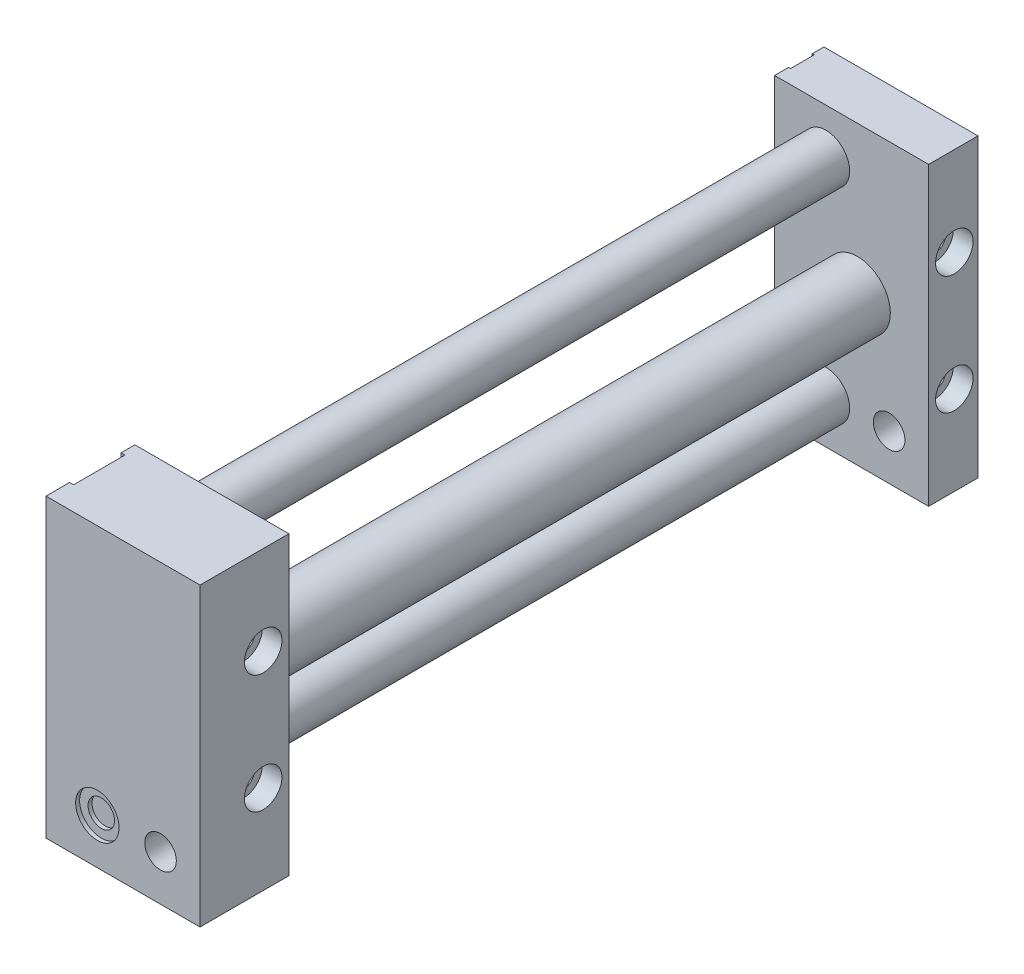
ISO-10303-21;
HEADER;
FILE_DESCRIPTION(('STEP AP214'),'2;1');
FILE_NAME('part.step','',(''),(''),'','','');
FILE_SCHEMA(('AUTOMOTIVE_DESIGN { 1 0 10303 214 1 1 1 1 }'));
ENDSEC;
DATA;
#1=APPLICATION_CONTEXT('core data for automotive mechanical design processes');
#2=APPLICATION_PROTOCOL_DEFINITION('international standard','automotive_design',2000,#1);
#3=PRODUCT_CONTEXT('',#1,'mechanical');
#4=PRODUCT('Part','Part','',(#3));
#5=PRODUCT_RELATED_PRODUCT_CATEGORY('part','',(#4));
#6=PRODUCT_DEFINITION_FORMATION('','',#4);
#7=PRODUCT_DEFINITION_CONTEXT('part definition',#1,'design');
#8=PRODUCT_DEFINITION('design','',#6,#7);
#9=PRODUCT_DEFINITION_SHAPE('','',#8);
#10=(LENGTH_UNIT() NAMED_UNIT(*) SI_UNIT(.MILLI.,.METRE.));
#11=(NAMED_UNIT(*) PLANE_ANGLE_UNIT() SI_UNIT($,.RADIAN.));
#12=(NAMED_UNIT(*) SI_UNIT($,.STERADIAN.) SOLID_ANGLE_UNIT());
#13=UNCERTAINTY_MEASURE_WITH_UNIT(LENGTH_MEASURE(1.E-05),#10,'distance_accuracy_value','');
#14=(GEOMETRIC_REPRESENTATION_CONTEXT(3) GLOBAL_UNCERTAINTY_ASSIGNED_CONTEXT((#13)) GLOBAL_UNIT_ASSIGNED_CONTEXT((#10,
#11,#12)) REPRESENTATION_CONTEXT('',''));
#15=CARTESIAN_POINT('',(0.,0.,0.));
#16=DIRECTION('',(0.,0.,1.));
#17=DIRECTION('',(1.,0.,0.));
#18=AXIS2_PLACEMENT_3D('',#15,#16,#17);
#19=CARTESIAN_POINT('',(-8.,-26.,-172.5));
#20=DIRECTION('',(0.,0.,1.));
#21=DIRECTION('',(1.,0.,0.));
#22=AXIS2_PLACEMENT_3D('',#19,#20,#21);
#23=PLANE('',#22);
#24=CARTESIAN_POINT('',(-8.,-26.,-172.5));
#25=DIRECTION('',(0.,0.,-1.));
#26=DIRECTION('',(-1.,0.,0.));
#27=AXIS2_PLACEMENT_3D('',#24,#25,#26);
#28=CIRCLE('',#27,3.35);
#29=CARTESIAN_POINT('',(-11.35,-26.,-172.5));
#30=VERTEX_POINT('',#29);
#31=EDGE_CURVE('E20',#30,#30,#28,.T.);
#32=ORIENTED_EDGE('',*,*,#31,.T.);
#33=EDGE_LOOP('',(#32));
#34=FACE_BOUND('',#33,.T.);
#35=ADVANCED_FACE('F17',(#34),#23,.F.);
#36=CARTESIAN_POINT('',(-8.,-26.,20.5));
#37=DIRECTION('',(0.,0.,1.));
#38=DIRECTION('',(1.,0.,0.));
#39=AXIS2_PLACEMENT_3D('',#36,#37,#38);
#40=PLANE('',#39);
#41=CARTESIAN_POINT('',(-8.,-26.,20.5));
#42=DIRECTION('',(0.,0.,1.));
#43=DIRECTION('',(1.,0.,0.));
#44=AXIS2_PLACEMENT_3D('',#41,#42,#43);
#45=CIRCLE('',#44,3.35);
#46=CARTESIAN_POINT('',(-4.65,-26.,20.5));
#47=VERTEX_POINT('',#46);
#48=EDGE_CURVE('E300',#47,#47,#45,.T.);
#49=ORIENTED_EDGE('',*,*,#48,.T.);
#50=EDGE_LOOP('',(#49));
#51=FACE_BOUND('',#50,.T.);
#52=ADVANCED_FACE('F138',(#51),#40,.T.);
#53=CARTESIAN_POINT('',(0.,0.,-168.499999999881));
#54=DIRECTION('',(0.,0.,-1.));
#55=DIRECTION('',(-1.,0.,0.));
#56=AXIS2_PLACEMENT_3D('',#53,#54,#55);
#57=CONICAL_SURFACE('',#56,2.06699999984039,1.04719755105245);
#58=CARTESIAN_POINT('',(2.55795384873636E-10,0.,-167.306616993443));
#59=VERTEX_POINT('',#58);
#60=VERTEX_LOOP('',#59);
#61=FACE_BOUND('',#60,.T.);
#62=CARTESIAN_POINT('',(0.,0.,-168.5));
#63=DIRECTION('',(0.,0.,1.));
#64=DIRECTION('',(1.,0.,0.));
#65=AXIS2_PLACEMENT_3D('',#62,#63,#64);
#66=CIRCLE('',#65,2.067);
#67=CARTESIAN_POINT('',(2.067,0.,-168.5));
#68=VERTEX_POINT('',#67);
#69=EDGE_CURVE('E142',#68,#68,#66,.F.);
#70=ORIENTED_EDGE('',*,*,#69,.T.);
#71=EDGE_LOOP('',(#70));
#72=FACE_BOUND('',#71,.T.);
#73=ADVANCED_FACE('F134',(#61,#72),#57,.F.);
#74=CARTESIAN_POINT('',(-8.,26.,-168.499999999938));
#75=DIRECTION('',(0.,0.,-1.));
#76=DIRECTION('',(-1.,0.,0.));
#77=AXIS2_PLACEMENT_3D('',#74,#75,#76);
#78=CONICAL_SURFACE('',#77,2.06699999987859,1.04719755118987);
#79=CARTESIAN_POINT('',(-7.99999999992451,26.,-167.306616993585));
#80=VERTEX_POINT('',#79);
#81=VERTEX_LOOP('',#80);
#82=FACE_BOUND('',#81,.T.);
#83=CARTESIAN_POINT('',(-8.,26.,-168.5));
#84=DIRECTION('',(0.,0.,1.));
#85=DIRECTION('',(1.,0.,0.));
#86=AXIS2_PLACEMENT_3D('',#83,#84,#85);
#87=CIRCLE('',#86,2.067);
#88=CARTESIAN_POINT('',(-5.933,26.,-168.5));
#89=VERTEX_POINT('',#88);
#90=EDGE_CURVE('E144',#89,#89,#87,.F.);
#91=ORIENTED_EDGE('',*,*,#90,.T.);
#92=EDGE_LOOP('',(#91));
#93=FACE_BOUND('',#92,.T.);
#94=ADVANCED_FACE('F137',(#82,#93),#78,.F.);
#95=CARTESIAN_POINT('',(-8.,-26.,-172.5));
#96=DIRECTION('',(0.,0.,-1.));
#97=DIRECTION('',(-1.,0.,0.));
#98=AXIS2_PLACEMENT_3D('',#95,#96,#97);
#99=CYLINDRICAL_SURFACE('',#98,3.35);
#100=ORIENTED_EDGE('',*,*,#31,.F.);
#101=EDGE_LOOP('',(#100));
#102=FACE_BOUND('',#101,.T.);
#103=CARTESIAN_POINT('',(-8.,-26.,-173.5));
#104=DIRECTION('',(0.,0.,-1.));
#105=DIRECTION('',(-1.,0.,0.));
#106=AXIS2_PLACEMENT_3D('',#103,#104,#105);
#107=CIRCLE('',#106,3.35);
#108=CARTESIAN_POINT('',(-11.35,-26.,-173.5));
#109=VERTEX_POINT('',#108);
#110=EDGE_CURVE('E148',#109,#109,#107,.T.);
#111=ORIENTED_EDGE('',*,*,#110,.T.);
#112=EDGE_LOOP('',(#111));
#113=FACE_BOUND('',#112,.T.);
#114=ADVANCED_FACE('F308',(#102,#113),#99,.F.);
#115=CARTESIAN_POINT('',(-11.5,15.,-170.9585));
#116=DIRECTION('',(1.,0.,0.));
#117=DIRECTION('',(0.,0.,-1.));
#118=AXIS2_PLACEMENT_3D('',#115,#116,#117);
#119=PLANE('',#118);
#120=CARTESIAN_POINT('',(-11.5,15.,-168.5));
#121=DIRECTION('',(-1.,0.,0.));
#122=DIRECTION('',(0.,0.,1.));
#123=AXIS2_PLACEMENT_3D('',#120,#121,#122);
#124=CIRCLE('',#123,2.8);
#125=CARTESIAN_POINT('',(-11.5,15.,-165.7));
#126=VERTEX_POINT('',#125);
#127=EDGE_CURVE('E151',#126,#126,#124,.F.);
#128=ORIENTED_EDGE('',*,*,#127,.T.);
#129=EDGE_LOOP('',(#128));
#130=FACE_BOUND('',#129,.T.);
#131=CARTESIAN_POINT('',(-11.5,15.,-168.5));
#132=DIRECTION('',(-1.,0.,0.));
#133=DIRECTION('',(0.,0.,1.));
#134=AXIS2_PLACEMENT_3D('',#131,#132,#133);
#135=CIRCLE('',#134,2.4585);
#136=CARTESIAN_POINT('',(-11.5,15.,-166.0415));
#137=VERTEX_POINT('',#136);
#138=EDGE_CURVE('E294',#137,#137,#135,.T.);
#139=ORIENTED_EDGE('',*,*,#138,.T.);
#140=EDGE_LOOP('',(#139));
#141=FACE_BOUND('',#140,.T.);
#142=ADVANCED_FACE('F311',(#130,#141),#119,.T.);
#143=CARTESIAN_POINT('',(-11.5,-15.,-170.9585));
#144=DIRECTION('',(1.,0.,0.));
#145=DIRECTION('',(0.,0.,-1.));
#146=AXIS2_PLACEMENT_3D('',#143,#144,#145);
#147=PLANE('',#146);
#148=CARTESIAN_POINT('',(-11.5,-15.,-168.5));
#149=DIRECTION('',(-1.,0.,0.));
#150=DIRECTION('',(0.,0.,1.));
#151=AXIS2_PLACEMENT_3D('',#148,#149,#150);
#152=CIRCLE('',#151,2.8);
#153=CARTESIAN_POINT('',(-11.5,-15.,-165.7));
#154=VERTEX_POINT('',#153);
#155=EDGE_CURVE('E145',#154,#154,#152,.F.);
#156=ORIENTED_EDGE('',*,*,#155,.T.);
#157=EDGE_LOOP('',(#156));
#158=FACE_BOUND('',#157,.T.);
#159=CARTESIAN_POINT('',(-11.5,-15.,-168.5));
#160=DIRECTION('',(-1.,0.,0.));
#161=DIRECTION('',(0.,0.,1.));
#162=AXIS2_PLACEMENT_3D('',#159,#160,#161);
#163=CIRCLE('',#162,2.4585);
#164=CARTESIAN_POINT('',(-11.5,-15.,-166.0415));
#165=VERTEX_POINT('',#164);
#166=EDGE_CURVE('E291',#165,#165,#163,.T.);
#167=ORIENTED_EDGE('',*,*,#166,.T.);
#168=EDGE_LOOP('',(#167));
#169=FACE_BOUND('',#168,.T.);
#170=ADVANCED_FACE('F605',(#158,#169),#147,.T.);
#171=CARTESIAN_POINT('',(-8.,-26.,20.5));
#172=DIRECTION('',(0.,0.,1.));
#173=DIRECTION('',(1.,0.,0.));
#174=AXIS2_PLACEMENT_3D('',#171,#172,#173);
#175=CYLINDRICAL_SURFACE('',#174,3.35);
#176=CARTESIAN_POINT('',(-8.,-26.,21.5));
#177=DIRECTION('',(0.,0.,1.));
#178=DIRECTION('',(1.,0.,0.));
#179=AXIS2_PLACEMENT_3D('',#176,#177,#178);
#180=CIRCLE('',#179,3.35);
#181=CARTESIAN_POINT('',(-4.65,-26.,21.5));
#182=VERTEX_POINT('',#181);
#183=EDGE_CURVE('E285',#182,#182,#180,.F.);
#184=ORIENTED_EDGE('',*,*,#183,.F.);
#185=EDGE_LOOP('',(#184));
#186=FACE_BOUND('',#185,.T.);
#187=ORIENTED_EDGE('',*,*,#48,.F.);
#188=EDGE_LOOP('',(#187));
#189=FACE_BOUND('',#188,.T.);
#190=ADVANCED_FACE('F601',(#186,#189),#175,.F.);
#191=CARTESIAN_POINT('',(18.,15.,-168.5));
#192=DIRECTION('',(-1.,0.,0.));
#193=DIRECTION('',(0.,0.,1.));
#194=AXIS2_PLACEMENT_3D('',#191,#192,#193);
#195=CYLINDRICAL_SURFACE('',#194,2.8);
#196=ORIENTED_EDGE('',*,*,#127,.F.);
#197=EDGE_LOOP('',(#196));
#198=FACE_BOUND('',#197,.T.);
#199=CARTESIAN_POINT('',(12.9999999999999,15.,-168.5));
#200=DIRECTION('',(-1.,0.,0.));
#201=DIRECTION('',(0.,0.,1.));
#202=AXIS2_PLACEMENT_3D('',#199,#200,#201);
#203=CIRCLE('',#202,2.8);
#204=CARTESIAN_POINT('',(12.9999999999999,15.,-165.7));
#205=VERTEX_POINT('',#204);
#206=EDGE_CURVE('E279',#205,#205,#203,.T.);
#207=ORIENTED_EDGE('',*,*,#206,.F.);
#208=EDGE_LOOP('',(#207));
#209=FACE_BOUND('',#208,.T.);
#210=ADVANCED_FACE('F597',(#198,#209),#195,.F.);
#211=CARTESIAN_POINT('',(18.,-15.,-168.5));
#212=DIRECTION('',(-1.,0.,0.));
#213=DIRECTION('',(0.,0.,1.));
#214=AXIS2_PLACEMENT_3D('',#211,#212,#213);
#215=CYLINDRICAL_SURFACE('',#214,2.8);
#216=ORIENTED_EDGE('',*,*,#155,.F.);
#217=EDGE_LOOP('',(#216));
#218=FACE_BOUND('',#217,.T.);
#219=CARTESIAN_POINT('',(12.9999999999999,-15.,-168.5));
#220=DIRECTION('',(-1.,0.,0.));
#221=DIRECTION('',(0.,0.,1.));
#222=AXIS2_PLACEMENT_3D('',#219,#220,#221);
#223=CIRCLE('',#222,2.8);
#224=CARTESIAN_POINT('',(12.9999999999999,-15.,-165.7));
#225=VERTEX_POINT('',#224);
#226=EDGE_CURVE('E275',#225,#225,#223,.T.);
#227=ORIENTED_EDGE('',*,*,#226,.F.);
#228=EDGE_LOOP('',(#227));
#229=FACE_BOUND('',#228,.T.);
#230=ADVANCED_FACE('F594',(#218,#229),#215,.F.);
#231=CARTESIAN_POINT('',(0.,0.,-174.5));
#232=DIRECTION('',(0.,0.,1.));
#233=DIRECTION('',(1.,0.,0.));
#234=AXIS2_PLACEMENT_3D('',#231,#232,#233);
#235=CYLINDRICAL_SURFACE('',#234,2.067);
#236=ORIENTED_EDGE('',*,*,#69,.F.);
#237=EDGE_LOOP('',(#236));
#238=FACE_BOUND('',#237,.T.);
#239=CARTESIAN_POINT('',(0.,0.,-174.067000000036));
#240=DIRECTION('',(0.,0.,-1.));
#241=DIRECTION('',(-1.,0.,0.));
#242=AXIS2_PLACEMENT_3D('',#239,#240,#241);
#243=CIRCLE('',#242,2.06700000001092);
#244=CARTESIAN_POINT('',(-2.06700000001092,0.,-174.067000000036));
#245=VERTEX_POINT('',#244);
#246=EDGE_CURVE('E278',#245,#245,#243,.T.);
#247=ORIENTED_EDGE('',*,*,#246,.T.);
#248=EDGE_LOOP('',(#247));
#249=FACE_BOUND('',#248,.T.);
#250=ADVANCED_FACE('F546',(#238,#249),#235,.F.);
#251=CARTESIAN_POINT('',(-8.,26.,-174.5));
#252=DIRECTION('',(0.,0.,1.));
#253=DIRECTION('',(1.,0.,0.));
#254=AXIS2_PLACEMENT_3D('',#251,#252,#253);
#255=CYLINDRICAL_SURFACE('',#254,2.067);
#256=ORIENTED_EDGE('',*,*,#90,.F.);
#257=EDGE_LOOP('',(#256));
#258=FACE_BOUND('',#257,.T.);
#259=CARTESIAN_POINT('',(-8.,26.,-174.067000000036));
#260=DIRECTION('',(0.,0.,-1.));
#261=DIRECTION('',(-1.,0.,0.));
#262=AXIS2_PLACEMENT_3D('',#259,#260,#261);
#263=CIRCLE('',#262,2.06699999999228);
#264=CARTESIAN_POINT('',(-10.0669999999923,26.,-174.067000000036));
#265=VERTEX_POINT('',#264);
#266=EDGE_CURVE('E274',#265,#265,#263,.T.);
#267=ORIENTED_EDGE('',*,*,#266,.T.);
#268=EDGE_LOOP('',(#267));
#269=FACE_BOUND('',#268,.T.);
#270=ADVANCED_FACE('F319',(#258,#269),#255,.F.);
#271=CARTESIAN_POINT('',(-8.,-26.,-173.5));
#272=DIRECTION('',(0.,0.,1.));
#273=DIRECTION('',(1.,0.,0.));
#274=AXIS2_PLACEMENT_3D('',#271,#272,#273);
#275=PLANE('',#274);
#276=ORIENTED_EDGE('',*,*,#110,.F.);
#277=EDGE_LOOP('',(#276));
#278=FACE_BOUND('',#277,.T.);
#279=CARTESIAN_POINT('',(-8.,-26.,-173.5));
#280=DIRECTION('',(0.,0.,-1.));
#281=DIRECTION('',(-1.,0.,0.));
#282=AXIS2_PLACEMENT_3D('',#279,#280,#281);
#283=CIRCLE('',#282,5.5);
#284=CARTESIAN_POINT('',(-13.5,-26.,-173.5));
#285=VERTEX_POINT('',#284);
#286=EDGE_CURVE('E270',#285,#285,#283,.T.);
#287=ORIENTED_EDGE('',*,*,#286,.T.);
#288=EDGE_LOOP('',(#287));
#289=FACE_BOUND('',#288,.T.);
#290=ADVANCED_FACE('F315',(#278,#289),#275,.F.);
#291=CARTESIAN_POINT('',(18.,15.,-168.5));
#292=DIRECTION('',(-1.,0.,0.));
#293=DIRECTION('',(0.,0.,1.));
#294=AXIS2_PLACEMENT_3D('',#291,#292,#293);
#295=CYLINDRICAL_SURFACE('',#294,2.4585);
#296=ORIENTED_EDGE('',*,*,#138,.F.);
#297=EDGE_LOOP('',(#296));
#298=FACE_BOUND('',#297,.T.);
#299=CARTESIAN_POINT('',(-20.4585000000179,15.,-168.5));
#300=DIRECTION('',(-1.,0.,0.));
#301=DIRECTION('',(0.,0.,1.));
#302=AXIS2_PLACEMENT_3D('',#299,#300,#301);
#303=CIRCLE('',#302,2.45849999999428);
#304=CARTESIAN_POINT('',(-20.4585000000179,15.,-166.041500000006));
#305=VERTEX_POINT('',#304);
#306=EDGE_CURVE('E273',#305,#305,#303,.T.);
#307=ORIENTED_EDGE('',*,*,#306,.T.);
#308=EDGE_LOOP('',(#307));
#309=FACE_BOUND('',#308,.T.);
#310=ADVANCED_FACE('F318',(#298,#309),#295,.F.);
#311=CARTESIAN_POINT('',(18.,-15.,-168.5));
#312=DIRECTION('',(-1.,0.,0.));
#313=DIRECTION('',(0.,0.,1.));
#314=AXIS2_PLACEMENT_3D('',#311,#312,#313);
#315=CYLINDRICAL_SURFACE('',#314,2.4585);
#316=ORIENTED_EDGE('',*,*,#166,.F.);
#317=EDGE_LOOP('',(#316));
#318=FACE_BOUND('',#317,.T.);
#319=CARTESIAN_POINT('',(-20.4585000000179,-15.,-168.5));
#320=DIRECTION('',(-1.,0.,0.));
#321=DIRECTION('',(0.,0.,1.));
#322=AXIS2_PLACEMENT_3D('',#319,#320,#321);
#323=CIRCLE('',#322,2.45849999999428);
#324=CARTESIAN_POINT('',(-20.4585000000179,-15.,-166.041500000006));
#325=VERTEX_POINT('',#324);
#326=EDGE_CURVE('E269',#325,#325,#323,.T.);
#327=ORIENTED_EDGE('',*,*,#326,.T.);
#328=EDGE_LOOP('',(#327));
#329=FACE_BOUND('',#328,.T.);
#330=ADVANCED_FACE('F581',(#318,#329),#315,.F.);
#331=CARTESIAN_POINT('',(-11.5,15.,4.0415));
#332=DIRECTION('',(1.,0.,0.));
#333=DIRECTION('',(0.,0.,-1.));
#334=AXIS2_PLACEMENT_3D('',#331,#332,#333);
#335=PLANE('',#334);
#336=CARTESIAN_POINT('',(-11.5,15.,6.5));
#337=DIRECTION('',(-1.,0.,0.));
#338=DIRECTION('',(0.,0.,1.));
#339=AXIS2_PLACEMENT_3D('',#336,#337,#338);
#340=CIRCLE('',#339,2.8);
#341=CARTESIAN_POINT('',(-11.5,15.,9.3));
#342=VERTEX_POINT('',#341);
#343=EDGE_CURVE('E288',#342,#342,#340,.F.);
#344=ORIENTED_EDGE('',*,*,#343,.T.);
#345=EDGE_LOOP('',(#344));
#346=FACE_BOUND('',#345,.T.);
#347=CARTESIAN_POINT('',(-11.5,15.,6.5));
#348=DIRECTION('',(-1.,0.,0.));
#349=DIRECTION('',(0.,0.,1.));
#350=AXIS2_PLACEMENT_3D('',#347,#348,#349);
#351=CIRCLE('',#350,2.4585);
#352=CARTESIAN_POINT('',(-11.5,15.,8.9585));
#353=VERTEX_POINT('',#352);
#354=EDGE_CURVE('E266',#353,#353,#351,.T.);
#355=ORIENTED_EDGE('',*,*,#354,.T.);
#356=EDGE_LOOP('',(#355));
#357=FACE_BOUND('',#356,.T.);
#358=ADVANCED_FACE('F577',(#346,#357),#335,.T.);
#359=CARTESIAN_POINT('',(-11.5,-15.,4.04150000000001));
#360=DIRECTION('',(1.,0.,0.));
#361=DIRECTION('',(0.,0.,-1.));
#362=AXIS2_PLACEMENT_3D('',#359,#360,#361);
#363=PLANE('',#362);
#364=CARTESIAN_POINT('',(-11.5,-15.,6.50000000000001));
#365=DIRECTION('',(-1.,0.,0.));
#366=DIRECTION('',(0.,0.,1.));
#367=AXIS2_PLACEMENT_3D('',#364,#365,#366);
#368=CIRCLE('',#367,2.8);
#369=CARTESIAN_POINT('',(-11.5,-15.,9.30000000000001));
#370=VERTEX_POINT('',#369);
#371=EDGE_CURVE('E282',#370,#370,#368,.F.);
#372=ORIENTED_EDGE('',*,*,#371,.T.);
#373=EDGE_LOOP('',(#372));
#374=FACE_BOUND('',#373,.T.);
#375=CARTESIAN_POINT('',(-11.5,-15.,6.50000000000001));
#376=DIRECTION('',(-1.,0.,0.));
#377=DIRECTION('',(0.,0.,1.));
#378=AXIS2_PLACEMENT_3D('',#375,#376,#377);
#379=CIRCLE('',#378,2.4585);
#380=CARTESIAN_POINT('',(-11.5,-15.,8.95850000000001));
#381=VERTEX_POINT('',#380);
#382=EDGE_CURVE('E262',#381,#381,#379,.T.);
#383=ORIENTED_EDGE('',*,*,#382,.T.);
#384=EDGE_LOOP('',(#383));
#385=FACE_BOUND('',#384,.T.);
#386=ADVANCED_FACE('F573',(#374,#385),#363,.T.);
#387=CARTESIAN_POINT('',(18.,15.,6.5));
#388=DIRECTION('',(-1.,0.,0.));
#389=DIRECTION('',(0.,0.,1.));
#390=AXIS2_PLACEMENT_3D('',#387,#388,#389);
#391=CYLINDRICAL_SURFACE('',#390,2.8);
#392=ORIENTED_EDGE('',*,*,#343,.F.);
#393=EDGE_LOOP('',(#392));
#394=FACE_BOUND('',#393,.T.);
#395=CARTESIAN_POINT('',(12.9999999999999,15.,6.5));
#396=DIRECTION('',(-1.,0.,0.));
#397=DIRECTION('',(0.,0.,1.));
#398=AXIS2_PLACEMENT_3D('',#395,#396,#397);
#399=CIRCLE('',#398,2.8);
#400=CARTESIAN_POINT('',(12.9999999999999,15.,9.3));
#401=VERTEX_POINT('',#400);
#402=EDGE_CURVE('E258',#401,#401,#399,.T.);
#403=ORIENTED_EDGE('',*,*,#402,.F.);
#404=EDGE_LOOP('',(#403));
#405=FACE_BOUND('',#404,.T.);
#406=ADVANCED_FACE('F569',(#394,#405),#391,.F.);
#407=CARTESIAN_POINT('',(-8.,-26.,21.5));
#408=DIRECTION('',(0.,0.,1.));
#409=DIRECTION('',(1.,0.,0.));
#410=AXIS2_PLACEMENT_3D('',#407,#408,#409);
#411=PLANE('',#410);
#412=CARTESIAN_POINT('',(-8.,-26.,21.5));
#413=DIRECTION('',(0.,0.,1.));
#414=DIRECTION('',(1.,0.,0.));
#415=AXIS2_PLACEMENT_3D('',#412,#413,#414);
#416=CIRCLE('',#415,5.5);
#417=CARTESIAN_POINT('',(-2.5,-26.,21.5));
#418=VERTEX_POINT('',#417);
#419=EDGE_CURVE('E255',#418,#418,#416,.T.);
#420=ORIENTED_EDGE('',*,*,#419,.T.);
#421=EDGE_LOOP('',(#420));
#422=FACE_BOUND('',#421,.T.);
#423=ORIENTED_EDGE('',*,*,#183,.T.);
#424=EDGE_LOOP('',(#423));
#425=FACE_BOUND('',#424,.T.);
#426=ADVANCED_FACE('F565',(#422,#425),#411,.T.);
#427=CARTESIAN_POINT('',(18.,-15.,6.50000000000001));
#428=DIRECTION('',(-1.,0.,0.));
#429=DIRECTION('',(0.,0.,1.));
#430=AXIS2_PLACEMENT_3D('',#427,#428,#429);
#431=CYLINDRICAL_SURFACE('',#430,2.8);
#432=ORIENTED_EDGE('',*,*,#371,.F.);
#433=EDGE_LOOP('',(#432));
#434=FACE_BOUND('',#433,.T.);
#435=CARTESIAN_POINT('',(12.9999999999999,-15.,6.50000000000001));
#436=DIRECTION('',(-1.,0.,0.));
#437=DIRECTION('',(0.,0.,1.));
#438=AXIS2_PLACEMENT_3D('',#435,#436,#437);
#439=CIRCLE('',#438,2.8);
#440=CARTESIAN_POINT('',(12.9999999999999,-15.,9.30000000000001));
#441=VERTEX_POINT('',#440);
#442=EDGE_CURVE('E252',#441,#441,#439,.T.);
#443=ORIENTED_EDGE('',*,*,#442,.F.);
#444=EDGE_LOOP('',(#443));
#445=FACE_BOUND('',#444,.T.);
#446=ADVANCED_FACE('F561',(#434,#445),#431,.F.);
#447=CARTESIAN_POINT('',(12.9999999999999,15.,-171.3));
#448=DIRECTION('',(1.,0.,0.));
#449=DIRECTION('',(0.,0.,-1.));
#450=AXIS2_PLACEMENT_3D('',#447,#448,#449);
#451=PLANE('',#450);
#452=CARTESIAN_POINT('',(12.9999999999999,15.,-168.5));
#453=DIRECTION('',(-1.,0.,0.));
#454=DIRECTION('',(0.,0.,1.));
#455=AXIS2_PLACEMENT_3D('',#452,#453,#454);
#456=CIRCLE('',#455,4.75);
#457=CARTESIAN_POINT('',(12.9999999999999,15.,-163.75));
#458=VERTEX_POINT('',#457);
#459=EDGE_CURVE('E249',#458,#458,#456,.F.);
#460=ORIENTED_EDGE('',*,*,#459,.T.);
#461=EDGE_LOOP('',(#460));
#462=FACE_BOUND('',#461,.T.);
#463=ORIENTED_EDGE('',*,*,#206,.T.);
#464=EDGE_LOOP('',(#463));
#465=FACE_BOUND('',#464,.T.);
#466=ADVANCED_FACE('F555',(#462,#465),#451,.T.);
#467=CARTESIAN_POINT('',(12.9999999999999,-15.,-171.3));
#468=DIRECTION('',(1.,0.,0.));
#469=DIRECTION('',(0.,0.,-1.));
#470=AXIS2_PLACEMENT_3D('',#467,#468,#469);
#471=PLANE('',#470);
#472=CARTESIAN_POINT('',(12.9999999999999,-15.,-168.5));
#473=DIRECTION('',(-1.,0.,0.));
#474=DIRECTION('',(0.,0.,1.));
#475=AXIS2_PLACEMENT_3D('',#472,#473,#474);
#476=CIRCLE('',#475,4.75);
#477=CARTESIAN_POINT('',(12.9999999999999,-15.,-163.75));
#478=VERTEX_POINT('',#477);
#479=EDGE_CURVE('E246',#478,#478,#476,.F.);
#480=ORIENTED_EDGE('',*,*,#479,.T.);
#481=EDGE_LOOP('',(#480));
#482=FACE_BOUND('',#481,.T.);
#483=ORIENTED_EDGE('',*,*,#226,.T.);
#484=EDGE_LOOP('',(#483));
#485=FACE_BOUND('',#484,.T.);
#486=ADVANCED_FACE('F549',(#482,#485),#471,.T.);
#487=CARTESIAN_POINT('',(0.,0.,-174.499999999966));
#488=DIRECTION('',(0.,0.,-1.));
#489=DIRECTION('',(-1.,0.,0.));
#490=AXIS2_PLACEMENT_3D('',#487,#488,#489);
#491=CONICAL_SURFACE('',#490,2.49999999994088,0.785398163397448);
#492=CARTESIAN_POINT('',(0.,0.,-174.500000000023));
#493=DIRECTION('',(0.,0.,-1.));
#494=DIRECTION('',(-1.,0.,0.));
#495=AXIS2_PLACEMENT_3D('',#492,#493,#494);
#496=CIRCLE('',#495,2.49999999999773);
#497=CARTESIAN_POINT('',(-2.49999999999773,0.,-174.500000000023));
#498=VERTEX_POINT('',#497);
#499=EDGE_CURVE('E243',#498,#498,#496,.T.);
#500=ORIENTED_EDGE('',*,*,#499,.T.);
#501=EDGE_LOOP('',(#500));
#502=FACE_BOUND('',#501,.T.);
#503=ORIENTED_EDGE('',*,*,#246,.F.);
#504=EDGE_LOOP('',(#503));
#505=FACE_BOUND('',#504,.T.);
#506=ADVANCED_FACE('F337',(#502,#505),#491,.F.);
#507=CARTESIAN_POINT('',(-8.,26.,-174.500000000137));
#508=DIRECTION('',(0.,0.,-1.));
#509=DIRECTION('',(-1.,0.,0.));
#510=AXIS2_PLACEMENT_3D('',#507,#508,#509);
#511=CONICAL_SURFACE('',#510,2.50000000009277,0.785398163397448);
#512=CARTESIAN_POINT('',(-8.,26.,-174.500000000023));
#513=DIRECTION('',(0.,0.,-1.));
#514=DIRECTION('',(-1.,0.,0.));
#515=AXIS2_PLACEMENT_3D('',#512,#513,#514);
#516=CIRCLE('',#515,2.49999999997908);
#517=CARTESIAN_POINT('',(-10.4999999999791,26.,-174.500000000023));
#518=VERTEX_POINT('',#517);
#519=EDGE_CURVE('E240',#518,#518,#516,.T.);
#520=ORIENTED_EDGE('',*,*,#519,.T.);
#521=EDGE_LOOP('',(#520));
#522=FACE_BOUND('',#521,.T.);
#523=ORIENTED_EDGE('',*,*,#266,.F.);
#524=EDGE_LOOP('',(#523));
#525=FACE_BOUND('',#524,.T.);
#526=ADVANCED_FACE('F326',(#522,#525),#511,.F.);
#527=CARTESIAN_POINT('',(-8.,-26.,-173.5));
#528=DIRECTION('',(0.,0.,-1.));
#529=DIRECTION('',(-1.,0.,0.));
#530=AXIS2_PLACEMENT_3D('',#527,#528,#529);
#531=CYLINDRICAL_SURFACE('',#530,5.5);
#532=CARTESIAN_POINT('',(-8.,-26.,-174.5));
#533=DIRECTION('',(0.,0.,-1.));
#534=DIRECTION('',(-1.,0.,0.));
#535=AXIS2_PLACEMENT_3D('',#532,#533,#534);
#536=CIRCLE('',#535,5.5);
#537=CARTESIAN_POINT('',(-13.5,-26.,-174.5));
#538=VERTEX_POINT('',#537);
#539=EDGE_CURVE('E236',#538,#538,#536,.T.);
#540=ORIENTED_EDGE('',*,*,#539,.T.);
#541=EDGE_LOOP('',(#540));
#542=FACE_BOUND('',#541,.T.);
#543=ORIENTED_EDGE('',*,*,#286,.F.);
#544=EDGE_LOOP('',(#543));
#545=FACE_BOUND('',#544,.T.);
#546=ADVANCED_FACE('F323',(#542,#545),#531,.F.);
#547=CARTESIAN_POINT('',(-20.5000000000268,15.,-168.5));
#548=DIRECTION('',(-1.,0.,0.));
#549=DIRECTION('',(0.,0.,1.));
#550=AXIS2_PLACEMENT_3D('',#547,#548,#549);
#551=CONICAL_SURFACE('',#550,2.50000000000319,0.785398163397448);
#552=ORIENTED_EDGE('',*,*,#306,.F.);
#553=EDGE_LOOP('',(#552));
#554=FACE_BOUND('',#553,.T.);
#555=CARTESIAN_POINT('',(-20.5000000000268,15.,-168.5));
#556=DIRECTION('',(-1.,0.,0.));
#557=DIRECTION('',(0.,0.,1.));
#558=AXIS2_PLACEMENT_3D('',#555,#556,#557);
#559=CIRCLE('',#558,2.50000000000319);
#560=CARTESIAN_POINT('',(-20.5000000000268,15.,-165.999999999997));
#561=VERTEX_POINT('',#560);
#562=EDGE_CURVE('E232',#561,#561,#559,.T.);
#563=ORIENTED_EDGE('',*,*,#562,.T.);
#564=EDGE_LOOP('',(#563));
#565=FACE_BOUND('',#564,.T.);
#566=ADVANCED_FACE('F325',(#554,#565),#551,.F.);
#567=CARTESIAN_POINT('',(-21.,37.5,-171.5));
#568=DIRECTION('',(0.,0.,-1.));
#569=DIRECTION('',(-1.,0.,0.));
#570=AXIS2_PLACEMENT_3D('',#567,#568,#569);
#571=PLANE('',#570);
#572=DIRECTION('',(-1.,0.,0.));
#573=VECTOR('',#572,1.);
#574=CARTESIAN_POINT('',(-21.,-37.5,-171.5));
#575=LINE('',#574,#573);
#576=CARTESIAN_POINT('',(-20.5,-37.5,-171.5));
#577=VERTEX_POINT('',#576);
#578=CARTESIAN_POINT('',(-21.,-37.5,-171.5));
#579=VERTEX_POINT('',#578);
#580=EDGE_CURVE('E485',#577,#579,#575,.T.);
#581=ORIENTED_EDGE('',*,*,#580,.F.);
#582=DIRECTION('',(0.,1.,0.));
#583=VECTOR('',#582,1.);
#584=CARTESIAN_POINT('',(-20.5,37.5,-171.5));
#585=LINE('',#584,#583);
#586=CARTESIAN_POINT('',(-20.5,37.5,-171.5));
#587=VERTEX_POINT('',#586);
#588=EDGE_CURVE('E231',#577,#587,#585,.T.);
#589=ORIENTED_EDGE('',*,*,#588,.T.);
#590=DIRECTION('',(-1.,0.,0.));
#591=VECTOR('',#590,1.);
#592=CARTESIAN_POINT('',(-21.,37.5,-171.5));
#593=LINE('',#592,#591);
#594=CARTESIAN_POINT('',(-21.,37.5,-171.5));
#595=VERTEX_POINT('',#594);
#596=EDGE_CURVE('E492',#595,#587,#593,.F.);
#597=ORIENTED_EDGE('',*,*,#596,.F.);
#598=DIRECTION('',(0.,1.,0.));
#599=VECTOR('',#598,1.);
#600=CARTESIAN_POINT('',(-21.,37.5,-171.5));
#601=LINE('',#600,#599);
#602=EDGE_CURVE('E239',#595,#579,#601,.F.);
#603=ORIENTED_EDGE('',*,*,#602,.T.);
#604=EDGE_LOOP('',(#581,#589,#597,#603));
#605=FACE_BOUND('',#604,.T.);
#606=ADVANCED_FACE('F334',(#605),#571,.F.);
#607=CARTESIAN_POINT('',(-20.5000000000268,-15.,-168.5));
#608=DIRECTION('',(-1.,0.,0.));
#609=DIRECTION('',(0.,0.,1.));
#610=AXIS2_PLACEMENT_3D('',#607,#608,#609);
#611=CONICAL_SURFACE('',#610,2.50000000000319,0.785398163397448);
#612=ORIENTED_EDGE('',*,*,#326,.F.);
#613=EDGE_LOOP('',(#612));
#614=FACE_BOUND('',#613,.T.);
#615=CARTESIAN_POINT('',(-20.5000000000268,-15.,-168.5));
#616=DIRECTION('',(-1.,0.,0.));
#617=DIRECTION('',(0.,0.,1.));
#618=AXIS2_PLACEMENT_3D('',#615,#616,#617);
#619=CIRCLE('',#618,2.50000000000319);
#620=CARTESIAN_POINT('',(-20.5000000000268,-15.,-165.999999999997));
#621=VERTEX_POINT('',#620);
#622=EDGE_CURVE('E227',#621,#621,#619,.T.);
#623=ORIENTED_EDGE('',*,*,#622,.T.);
#624=EDGE_LOOP('',(#623));
#625=FACE_BOUND('',#624,.T.);
#626=ADVANCED_FACE('F474',(#614,#625),#611,.F.);
#627=CARTESIAN_POINT('',(18.,15.,6.5));
#628=DIRECTION('',(-1.,0.,0.));
#629=DIRECTION('',(0.,0.,1.));
#630=AXIS2_PLACEMENT_3D('',#627,#628,#629);
#631=CYLINDRICAL_SURFACE('',#630,2.4585);
#632=ORIENTED_EDGE('',*,*,#354,.F.);
#633=EDGE_LOOP('',(#632));
#634=FACE_BOUND('',#633,.T.);
#635=CARTESIAN_POINT('',(-20.,15.,6.5));
#636=DIRECTION('',(-1.,0.,0.));
#637=DIRECTION('',(0.,0.,1.));
#638=AXIS2_PLACEMENT_3D('',#635,#636,#637);
#639=CIRCLE('',#638,2.4585);
#640=CARTESIAN_POINT('',(-20.,15.,8.9585));
#641=VERTEX_POINT('',#640);
#642=EDGE_CURVE('E222',#641,#641,#639,.T.);
#643=ORIENTED_EDGE('',*,*,#642,.T.);
#644=EDGE_LOOP('',(#643));
#645=FACE_BOUND('',#644,.T.);
#646=ADVANCED_FACE('F470',(#634,#645),#631,.F.);
#647=CARTESIAN_POINT('',(18.,-15.,6.50000000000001));
#648=DIRECTION('',(-1.,0.,0.));
#649=DIRECTION('',(0.,0.,1.));
#650=AXIS2_PLACEMENT_3D('',#647,#648,#649);
#651=CYLINDRICAL_SURFACE('',#650,2.4585);
#652=ORIENTED_EDGE('',*,*,#382,.F.);
#653=EDGE_LOOP('',(#652));
#654=FACE_BOUND('',#653,.T.);
#655=CARTESIAN_POINT('',(-20.,-15.,6.50000000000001));
#656=DIRECTION('',(-1.,0.,0.));
#657=DIRECTION('',(0.,0.,1.));
#658=AXIS2_PLACEMENT_3D('',#655,#656,#657);
#659=CIRCLE('',#658,2.4585);
#660=CARTESIAN_POINT('',(-20.,-15.,8.95850000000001));
#661=VERTEX_POINT('',#660);
#662=EDGE_CURVE('E218',#661,#661,#659,.T.);
#663=ORIENTED_EDGE('',*,*,#662,.T.);
#664=EDGE_LOOP('',(#663));
#665=FACE_BOUND('',#664,.T.);
#666=ADVANCED_FACE('F466',(#654,#665),#651,.F.);
#667=CARTESIAN_POINT('',(-20.,37.5,16.5));
#668=DIRECTION('',(0.,0.,1.));
#669=DIRECTION('',(1.,0.,0.));
#670=AXIS2_PLACEMENT_3D('',#667,#668,#669);
#671=PLANE('',#670);
#672=DIRECTION('',(1.,0.,0.));
#673=VECTOR('',#672,1.);
#674=CARTESIAN_POINT('',(-20.,-37.5,16.5));
#675=LINE('',#674,#673);
#676=CARTESIAN_POINT('',(-21.,-37.5,16.5));
#677=VERTEX_POINT('',#676);
#678=CARTESIAN_POINT('',(-20.,-37.5,16.5));
#679=VERTEX_POINT('',#678);
#680=EDGE_CURVE('E261',#677,#679,#675,.T.);
#681=ORIENTED_EDGE('',*,*,#680,.F.);
#682=DIRECTION('',(0.,1.,0.));
#683=VECTOR('',#682,1.);
#684=CARTESIAN_POINT('',(-21.,37.5,16.5));
#685=LINE('',#684,#683);
#686=CARTESIAN_POINT('',(-21.,37.5,16.5));
#687=VERTEX_POINT('',#686);
#688=EDGE_CURVE('E217',#677,#687,#685,.T.);
#689=ORIENTED_EDGE('',*,*,#688,.T.);
#690=DIRECTION('',(1.,0.,0.));
#691=VECTOR('',#690,1.);
#692=CARTESIAN_POINT('',(-20.,37.5,16.5));
#693=LINE('',#692,#691);
#694=CARTESIAN_POINT('',(-20.,37.5,16.5));
#695=VERTEX_POINT('',#694);
#696=EDGE_CURVE('E265',#695,#687,#693,.F.);
#697=ORIENTED_EDGE('',*,*,#696,.F.);
#698=DIRECTION('',(0.,1.,0.));
#699=VECTOR('',#698,1.);
#700=CARTESIAN_POINT('',(-20.,37.5,16.5));
#701=LINE('',#700,#699);
#702=EDGE_CURVE('E225',#695,#679,#701,.F.);
#703=ORIENTED_EDGE('',*,*,#702,.T.);
#704=EDGE_LOOP('',(#681,#689,#697,#703));
#705=FACE_BOUND('',#704,.T.);
#706=ADVANCED_FACE('F462',(#705),#671,.F.);
#707=CARTESIAN_POINT('',(12.9999999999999,15.,3.7));
#708=DIRECTION('',(1.,0.,0.));
#709=DIRECTION('',(0.,0.,-1.));
#710=AXIS2_PLACEMENT_3D('',#707,#708,#709);
#711=PLANE('',#710);
#712=CARTESIAN_POINT('',(12.9999999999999,15.,6.5));
#713=DIRECTION('',(-1.,0.,0.));
#714=DIRECTION('',(0.,0.,1.));
#715=AXIS2_PLACEMENT_3D('',#712,#713,#714);
#716=CIRCLE('',#715,4.75);
#717=CARTESIAN_POINT('',(12.9999999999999,15.,11.25));
#718=VERTEX_POINT('',#717);
#719=EDGE_CURVE('E214',#718,#718,#716,.F.);
#720=ORIENTED_EDGE('',*,*,#719,.T.);
#721=EDGE_LOOP('',(#720));
#722=FACE_BOUND('',#721,.T.);
#723=ORIENTED_EDGE('',*,*,#402,.T.);
#724=EDGE_LOOP('',(#723));
#725=FACE_BOUND('',#724,.T.);
#726=ADVANCED_FACE('F458',(#722,#725),#711,.T.);
#727=CARTESIAN_POINT('',(-8.,-26.,21.5));
#728=DIRECTION('',(0.,0.,1.));
#729=DIRECTION('',(1.,0.,0.));
#730=AXIS2_PLACEMENT_3D('',#727,#728,#729);
#731=CYLINDRICAL_SURFACE('',#730,5.5);
#732=ORIENTED_EDGE('',*,*,#419,.F.);
#733=EDGE_LOOP('',(#732));
#734=FACE_BOUND('',#733,.T.);
#735=CARTESIAN_POINT('',(-8.,-26.,22.5));
#736=DIRECTION('',(0.,0.,1.));
#737=DIRECTION('',(1.,0.,0.));
#738=AXIS2_PLACEMENT_3D('',#735,#736,#737);
#739=CIRCLE('',#738,5.5);
#740=CARTESIAN_POINT('',(-2.5,-26.,22.5));
#741=VERTEX_POINT('',#740);
#742=EDGE_CURVE('E211',#741,#741,#739,.T.);
#743=ORIENTED_EDGE('',*,*,#742,.T.);
#744=EDGE_LOOP('',(#743));
#745=FACE_BOUND('',#744,.T.);
#746=ADVANCED_FACE('F454',(#734,#745),#731,.F.);
#747=CARTESIAN_POINT('',(12.9999999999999,-15.,3.70000000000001));
#748=DIRECTION('',(1.,0.,0.));
#749=DIRECTION('',(0.,0.,-1.));
#750=AXIS2_PLACEMENT_3D('',#747,#748,#749);
#751=PLANE('',#750);
#752=CARTESIAN_POINT('',(12.9999999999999,-15.,6.50000000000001));
#753=DIRECTION('',(-1.,0.,0.));
#754=DIRECTION('',(0.,0.,1.));
#755=AXIS2_PLACEMENT_3D('',#752,#753,#754);
#756=CIRCLE('',#755,4.75);
#757=CARTESIAN_POINT('',(12.9999999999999,-15.,11.25));
#758=VERTEX_POINT('',#757);
#759=EDGE_CURVE('E207',#758,#758,#756,.F.);
#760=ORIENTED_EDGE('',*,*,#759,.T.);
#761=EDGE_LOOP('',(#760));
#762=FACE_BOUND('',#761,.T.);
#763=ORIENTED_EDGE('',*,*,#442,.T.);
#764=EDGE_LOOP('',(#763));
#765=FACE_BOUND('',#764,.T.);
#766=ADVANCED_FACE('F450',(#762,#765),#751,.T.);
#767=CARTESIAN_POINT('',(18.,15.,-168.5));
#768=DIRECTION('',(-1.,0.,0.));
#769=DIRECTION('',(0.,0.,1.));
#770=AXIS2_PLACEMENT_3D('',#767,#768,#769);
#771=CYLINDRICAL_SURFACE('',#770,4.75);
#772=CARTESIAN_POINT('',(18.,15.,-168.5));
#773=DIRECTION('',(-1.,0.,0.));
#774=DIRECTION('',(0.,0.,1.));
#775=AXIS2_PLACEMENT_3D('',#772,#773,#774);
#776=CIRCLE('',#775,4.75);
#777=CARTESIAN_POINT('',(18.,15.,-163.75));
#778=VERTEX_POINT('',#777);
#779=EDGE_CURVE('E198',#778,#778,#776,.F.);
#780=ORIENTED_EDGE('',*,*,#779,.T.);
#781=EDGE_LOOP('',(#780));
#782=FACE_BOUND('',#781,.T.);
#783=ORIENTED_EDGE('',*,*,#459,.F.);
#784=EDGE_LOOP('',(#783));
#785=FACE_BOUND('',#784,.T.);
#786=ADVANCED_FACE('F446',(#782,#785),#771,.F.);
#787=CARTESIAN_POINT('',(18.,-15.,-168.5));
#788=DIRECTION('',(-1.,0.,0.));
#789=DIRECTION('',(0.,0.,1.));
#790=AXIS2_PLACEMENT_3D('',#787,#788,#789);
#791=CYLINDRICAL_SURFACE('',#790,4.75);
#792=CARTESIAN_POINT('',(18.,-15.,-168.5));
#793=DIRECTION('',(-1.,0.,0.));
#794=DIRECTION('',(0.,0.,1.));
#795=AXIS2_PLACEMENT_3D('',#792,#793,#794);
#796=CIRCLE('',#795,4.75);
#797=CARTESIAN_POINT('',(18.,-15.,-163.75));
#798=VERTEX_POINT('',#797);
#799=EDGE_CURVE('E193',#798,#798,#796,.F.);
#800=ORIENTED_EDGE('',*,*,#799,.T.);
#801=EDGE_LOOP('',(#800));
#802=FACE_BOUND('',#801,.T.);
#803=ORIENTED_EDGE('',*,*,#479,.F.);
#804=EDGE_LOOP('',(#803));
#805=FACE_BOUND('',#804,.T.);
#806=ADVANCED_FACE('F442',(#802,#805),#791,.F.);
#807=CARTESIAN_POINT('',(18.,37.5,-174.5));
#808=DIRECTION('',(0.,0.,1.));
#809=DIRECTION('',(1.,0.,0.));
#810=AXIS2_PLACEMENT_3D('',#807,#808,#809);
#811=PLANE('',#810);
#812=ORIENTED_EDGE('',*,*,#539,.F.);
#813=EDGE_LOOP('',(#812));
#814=FACE_BOUND('',#813,.T.);
#815=CARTESIAN_POINT('',(8.,-26.,-174.5));
#816=DIRECTION('',(0.,0.,1.));
#817=DIRECTION('',(1.,0.,0.));
#818=AXIS2_PLACEMENT_3D('',#815,#816,#817);
#819=CIRCLE('',#818,4.);
#820=CARTESIAN_POINT('',(12.,-26.,-174.5));
#821=VERTEX_POINT('',#820);
#822=EDGE_CURVE('E203',#821,#821,#819,.T.);
#823=ORIENTED_EDGE('',*,*,#822,.T.);
#824=EDGE_LOOP('',(#823));
#825=FACE_BOUND('',#824,.T.);
#826=ORIENTED_EDGE('',*,*,#519,.F.);
#827=EDGE_LOOP('',(#826));
#828=FACE_BOUND('',#827,.T.);
#829=DIRECTION('',(1.,0.,0.));
#830=VECTOR('',#829,1.);
#831=CARTESIAN_POINT('',(0.,-37.5,-174.5));
#832=LINE('',#831,#830);
#833=CARTESIAN_POINT('',(18.,-37.5,-174.5));
#834=VERTEX_POINT('',#833);
#835=CARTESIAN_POINT('',(-21.,-37.5,-174.5));
#836=VERTEX_POINT('',#835);
#837=EDGE_CURVE('E508',#834,#836,#832,.F.);
#838=ORIENTED_EDGE('',*,*,#837,.T.);
#839=DIRECTION('',(0.,1.,0.));
#840=VECTOR('',#839,1.);
#841=CARTESIAN_POINT('',(-21.,37.5,-174.5));
#842=LINE('',#841,#840);
#843=CARTESIAN_POINT('',(-21.,37.5,-174.5));
#844=VERTEX_POINT('',#843);
#845=EDGE_CURVE('E235',#836,#844,#842,.T.);
#846=ORIENTED_EDGE('',*,*,#845,.T.);
#847=DIRECTION('',(1.,0.,0.));
#848=VECTOR('',#847,1.);
#849=CARTESIAN_POINT('',(0.,37.5,-174.5));
#850=LINE('',#849,#848);
#851=CARTESIAN_POINT('',(18.,37.5,-174.5));
#852=VERTEX_POINT('',#851);
#853=EDGE_CURVE('E206',#852,#844,#850,.F.);
#854=ORIENTED_EDGE('',*,*,#853,.F.);
#855=DIRECTION('',(0.,1.,0.));
#856=VECTOR('',#855,1.);
#857=CARTESIAN_POINT('',(18.,37.5,-174.5));
#858=LINE('',#857,#856);
#859=EDGE_CURVE('E197',#852,#834,#858,.F.);
#860=ORIENTED_EDGE('',*,*,#859,.T.);
#861=EDGE_LOOP('',(#838,#846,#854,#860));
#862=FACE_BOUND('',#861,.T.);
#863=ORIENTED_EDGE('',*,*,#499,.F.);
#864=EDGE_LOOP('',(#863));
#865=FACE_BOUND('',#864,.T.);
#866=ADVANCED_FACE('F438',(#814,#825,#828,#862,#865),#811,.F.);
#867=CARTESIAN_POINT('',(-21.,37.5,-174.5));
#868=DIRECTION('',(1.,0.,0.));
#869=DIRECTION('',(0.,0.,-1.));
#870=AXIS2_PLACEMENT_3D('',#867,#868,#869);
#871=PLANE('',#870);
#872=DIRECTION('',(0.,0.,1.));
#873=VECTOR('',#872,1.);
#874=CARTESIAN_POINT('',(-21.,-37.5,0.));
#875=LINE('',#874,#873);
#876=EDGE_CURVE('E504',#836,#579,#875,.T.);
#877=ORIENTED_EDGE('',*,*,#876,.T.);
#878=ORIENTED_EDGE('',*,*,#602,.F.);
#879=DIRECTION('',(0.,0.,1.));
#880=VECTOR('',#879,1.);
#881=CARTESIAN_POINT('',(-21.,37.5,0.));
#882=LINE('',#881,#880);
#883=EDGE_CURVE('E520',#844,#595,#882,.T.);
#884=ORIENTED_EDGE('',*,*,#883,.F.);
#885=ORIENTED_EDGE('',*,*,#845,.F.);
#886=EDGE_LOOP('',(#877,#878,#884,#885));
#887=FACE_BOUND('',#886,.T.);
#888=ADVANCED_FACE('F434',(#887),#871,.F.);
#889=CARTESIAN_POINT('',(-20.5,37.5,-171.5));
#890=DIRECTION('',(1.,0.,0.));
#891=DIRECTION('',(0.,0.,-1.));
#892=AXIS2_PLACEMENT_3D('',#889,#890,#891);
#893=PLANE('',#892);
#894=ORIENTED_EDGE('',*,*,#622,.F.);
#895=EDGE_LOOP('',(#894));
#896=FACE_BOUND('',#895,.T.);
#897=DIRECTION('',(0.,0.,1.));
#898=VECTOR('',#897,1.);
#899=CARTESIAN_POINT('',(-20.5,-37.5,0.));
#900=LINE('',#899,#898);
#901=CARTESIAN_POINT('',(-20.5,-37.5,-165.5));
#902=VERTEX_POINT('',#901);
#903=EDGE_CURVE('E496',#577,#902,#900,.T.);
#904=ORIENTED_EDGE('',*,*,#903,.T.);
#905=DIRECTION('',(0.,1.,0.));
#906=VECTOR('',#905,1.);
#907=CARTESIAN_POINT('',(-20.5,37.5,-165.5));
#908=LINE('',#907,#906);
#909=CARTESIAN_POINT('',(-20.5,37.5,-165.5));
#910=VERTEX_POINT('',#909);
#911=EDGE_CURVE('E230',#902,#910,#908,.T.);
#912=ORIENTED_EDGE('',*,*,#911,.T.);
#913=DIRECTION('',(0.,0.,1.));
#914=VECTOR('',#913,1.);
#915=CARTESIAN_POINT('',(-20.5,37.5,0.));
#916=LINE('',#915,#914);
#917=EDGE_CURVE('E499',#587,#910,#916,.T.);
#918=ORIENTED_EDGE('',*,*,#917,.F.);
#919=ORIENTED_EDGE('',*,*,#588,.F.);
#920=EDGE_LOOP('',(#904,#912,#918,#919));
#921=FACE_BOUND('',#920,.T.);
#922=ORIENTED_EDGE('',*,*,#562,.F.);
#923=EDGE_LOOP('',(#922));
#924=FACE_BOUND('',#923,.T.);
#925=ADVANCED_FACE('F430',(#896,#921,#924),#893,.F.);
#926=CARTESIAN_POINT('',(-20.5,37.5,-165.5));
#927=DIRECTION('',(0.,0.,1.));
#928=DIRECTION('',(1.,0.,0.));
#929=AXIS2_PLACEMENT_3D('',#926,#927,#928);
#930=PLANE('',#929);
#931=DIRECTION('',(1.,0.,0.));
#932=VECTOR('',#931,1.);
#933=CARTESIAN_POINT('',(0.,-37.5,-165.5));
#934=LINE('',#933,#932);
#935=CARTESIAN_POINT('',(-21.,-37.5,-165.5));
#936=VERTEX_POINT('',#935);
#937=EDGE_CURVE('E503',#902,#936,#934,.F.);
#938=ORIENTED_EDGE('',*,*,#937,.T.);
#939=DIRECTION('',(0.,1.,0.));
#940=VECTOR('',#939,1.);
#941=CARTESIAN_POINT('',(-21.,37.5,-165.5));
#942=LINE('',#941,#940);
#943=CARTESIAN_POINT('',(-21.,37.5,-165.5));
#944=VERTEX_POINT('',#943);
#945=EDGE_CURVE('E192',#936,#944,#942,.T.);
#946=ORIENTED_EDGE('',*,*,#945,.T.);
#947=DIRECTION('',(1.,0.,0.));
#948=VECTOR('',#947,1.);
#949=CARTESIAN_POINT('',(0.,37.5,-165.5));
#950=LINE('',#949,#948);
#951=EDGE_CURVE('E202',#910,#944,#950,.F.);
#952=ORIENTED_EDGE('',*,*,#951,.F.);
#953=ORIENTED_EDGE('',*,*,#911,.F.);
#954=EDGE_LOOP('',(#938,#946,#952,#953));
#955=FACE_BOUND('',#954,.T.);
#956=ADVANCED_FACE('F426',(#955),#930,.F.);
#957=CARTESIAN_POINT('',(-21.,37.5,3.5));
#958=DIRECTION('',(0.,0.,-1.));
#959=DIRECTION('',(-1.,0.,0.));
#960=AXIS2_PLACEMENT_3D('',#957,#958,#959);
#961=PLANE('',#960);
#962=DIRECTION('',(-1.,0.,0.));
#963=VECTOR('',#962,1.);
#964=CARTESIAN_POINT('',(-21.,-37.5,3.5));
#965=LINE('',#964,#963);
#966=CARTESIAN_POINT('',(-20.,-37.5,3.5));
#967=VERTEX_POINT('',#966);
#968=CARTESIAN_POINT('',(-21.,-37.5,3.5));
#969=VERTEX_POINT('',#968);
#970=EDGE_CURVE('E226',#967,#969,#965,.T.);
#971=ORIENTED_EDGE('',*,*,#970,.F.);
#972=DIRECTION('',(0.,1.,0.));
#973=VECTOR('',#972,1.);
#974=CARTESIAN_POINT('',(-20.,37.5,3.5));
#975=LINE('',#974,#973);
#976=CARTESIAN_POINT('',(-20.,37.5,3.5));
#977=VERTEX_POINT('',#976);
#978=EDGE_CURVE('E221',#967,#977,#975,.T.);
#979=ORIENTED_EDGE('',*,*,#978,.T.);
#980=DIRECTION('',(1.,0.,0.));
#981=VECTOR('',#980,1.);
#982=CARTESIAN_POINT('',(0.,37.5,3.5));
#983=LINE('',#982,#981);
#984=CARTESIAN_POINT('',(-21.,37.5,3.5));
#985=VERTEX_POINT('',#984);
#986=EDGE_CURVE('E191',#985,#977,#983,.T.);
#987=ORIENTED_EDGE('',*,*,#986,.F.);
#988=DIRECTION('',(0.,1.,0.));
#989=VECTOR('',#988,1.);
#990=CARTESIAN_POINT('',(-21.,37.5,3.5));
#991=LINE('',#990,#989);
#992=EDGE_CURVE('E1081',#985,#969,#991,.F.);
#993=ORIENTED_EDGE('',*,*,#992,.T.);
#994=EDGE_LOOP('',(#971,#979,#987,#993));
#995=FACE_BOUND('',#994,.T.);
#996=ADVANCED_FACE('F422',(#995),#961,.F.);
#997=CARTESIAN_POINT('',(-20.,37.5,3.5));
#998=DIRECTION('',(1.,0.,0.));
#999=DIRECTION('',(0.,0.,-1.));
#1000=AXIS2_PLACEMENT_3D('',#997,#998,#999);
#1001=PLANE('',#1000);
#1002=ORIENTED_EDGE('',*,*,#662,.F.);
#1003=EDGE_LOOP('',(#1002));
#1004=FACE_BOUND('',#1003,.T.);
#1005=DIRECTION('',(0.,0.,1.));
#1006=VECTOR('',#1005,1.);
#1007=CARTESIAN_POINT('',(-20.,-37.5,0.));
#1008=LINE('',#1007,#1006);
#1009=EDGE_CURVE('E1073',#967,#679,#1008,.T.);
#1010=ORIENTED_EDGE('',*,*,#1009,.T.);
#1011=ORIENTED_EDGE('',*,*,#702,.F.);
#1012=DIRECTION('',(0.,0.,1.));
#1013=VECTOR('',#1012,1.);
#1014=CARTESIAN_POINT('',(-20.,37.5,0.));
#1015=LINE('',#1014,#1013);
#1016=EDGE_CURVE('E1095',#977,#695,#1015,.T.);
#1017=ORIENTED_EDGE('',*,*,#1016,.F.);
#1018=ORIENTED_EDGE('',*,*,#978,.F.);
#1019=EDGE_LOOP('',(#1010,#1011,#1017,#1018));
#1020=FACE_BOUND('',#1019,.T.);
#1021=ORIENTED_EDGE('',*,*,#642,.F.);
#1022=EDGE_LOOP('',(#1021));
#1023=FACE_BOUND('',#1022,.T.);
#1024=ADVANCED_FACE('F418',(#1004,#1020,#1023),#1001,.F.);
#1025=CARTESIAN_POINT('',(-21.,37.5,16.5));
#1026=DIRECTION('',(1.,0.,0.));
#1027=DIRECTION('',(0.,0.,-1.));
#1028=AXIS2_PLACEMENT_3D('',#1025,#1026,#1027);
#1029=PLANE('',#1028);
#1030=DIRECTION('',(0.,0.,1.));
#1031=VECTOR('',#1030,1.);
#1032=CARTESIAN_POINT('',(-21.,-37.5,0.));
#1033=LINE('',#1032,#1031);
#1034=CARTESIAN_POINT('',(-21.,-37.5,22.5));
#1035=VERTEX_POINT('',#1034);
#1036=EDGE_CURVE('E1076',#677,#1035,#1033,.T.);
#1037=ORIENTED_EDGE('',*,*,#1036,.T.);
#1038=DIRECTION('',(0.,1.,0.));
#1039=VECTOR('',#1038,1.);
#1040=CARTESIAN_POINT('',(-21.,37.5,22.5));
#1041=LINE('',#1040,#1039);
#1042=CARTESIAN_POINT('',(-21.,37.5,22.5));
#1043=VERTEX_POINT('',#1042);
#1044=EDGE_CURVE('E210',#1035,#1043,#1041,.T.);
#1045=ORIENTED_EDGE('',*,*,#1044,.T.);
#1046=DIRECTION('',(0.,0.,1.));
#1047=VECTOR('',#1046,1.);
#1048=CARTESIAN_POINT('',(-21.,37.5,0.));
#1049=LINE('',#1048,#1047);
#1050=EDGE_CURVE('E1092',#687,#1043,#1049,.T.);
#1051=ORIENTED_EDGE('',*,*,#1050,.F.);
#1052=ORIENTED_EDGE('',*,*,#688,.F.);
#1053=EDGE_LOOP('',(#1037,#1045,#1051,#1052));
#1054=FACE_BOUND('',#1053,.T.);
#1055=ADVANCED_FACE('F414',(#1054),#1029,.F.);
#1056=CARTESIAN_POINT('',(18.,15.,6.5));
#1057=DIRECTION('',(-1.,0.,0.));
#1058=DIRECTION('',(0.,0.,1.));
#1059=AXIS2_PLACEMENT_3D('',#1056,#1057,#1058);
#1060=CYLINDRICAL_SURFACE('',#1059,4.75);
#1061=CARTESIAN_POINT('',(18.,15.,6.5));
#1062=DIRECTION('',(-1.,0.,0.));
#1063=DIRECTION('',(0.,0.,1.));
#1064=AXIS2_PLACEMENT_3D('',#1061,#1062,#1063);
#1065=CIRCLE('',#1064,4.75);
#1066=CARTESIAN_POINT('',(18.,15.,11.25));
#1067=VERTEX_POINT('',#1066);
#1068=EDGE_CURVE('E183',#1067,#1067,#1065,.F.);
#1069=ORIENTED_EDGE('',*,*,#1068,.T.);
#1070=EDGE_LOOP('',(#1069));
#1071=FACE_BOUND('',#1070,.T.);
#1072=ORIENTED_EDGE('',*,*,#719,.F.);
#1073=EDGE_LOOP('',(#1072));
#1074=FACE_BOUND('',#1073,.T.);
#1075=ADVANCED_FACE('F410',(#1071,#1074),#1060,.F.);
#1076=CARTESIAN_POINT('',(-21.,37.5,22.5));
#1077=DIRECTION('',(0.,0.,-1.));
#1078=DIRECTION('',(-1.,0.,0.));
#1079=AXIS2_PLACEMENT_3D('',#1076,#1077,#1078);
#1080=PLANE('',#1079);
#1081=DIRECTION('',(1.,0.,0.));
#1082=VECTOR('',#1081,1.);
#1083=CARTESIAN_POINT('',(0.,-37.5,22.5));
#1084=LINE('',#1083,#1082);
#1085=CARTESIAN_POINT('',(18.,-37.5,22.5));
#1086=VERTEX_POINT('',#1085);
#1087=EDGE_CURVE('E187',#1035,#1086,#1084,.T.);
#1088=ORIENTED_EDGE('',*,*,#1087,.T.);
#1089=DIRECTION('',(0.,1.,0.));
#1090=VECTOR('',#1089,1.);
#1091=CARTESIAN_POINT('',(18.,37.5,22.5));
#1092=LINE('',#1091,#1090);
#1093=CARTESIAN_POINT('',(18.,37.5,22.5));
#1094=VERTEX_POINT('',#1093);
#1095=EDGE_CURVE('E182',#1086,#1094,#1092,.T.);
#1096=ORIENTED_EDGE('',*,*,#1095,.T.);
#1097=DIRECTION('',(1.,0.,0.));
#1098=VECTOR('',#1097,1.);
#1099=CARTESIAN_POINT('',(0.,37.5,22.5));
#1100=LINE('',#1099,#1098);
#1101=EDGE_CURVE('E1090',#1043,#1094,#1100,.T.);
#1102=ORIENTED_EDGE('',*,*,#1101,.F.);
#1103=ORIENTED_EDGE('',*,*,#1044,.F.);
#1104=EDGE_LOOP('',(#1088,#1096,#1102,#1103));
#1105=FACE_BOUND('',#1104,.T.);
#1106=CARTESIAN_POINT('',(8.,-26.,22.5));
#1107=DIRECTION('',(0.,0.,1.));
#1108=DIRECTION('',(1.,0.,0.));
#1109=AXIS2_PLACEMENT_3D('',#1106,#1107,#1108);
#1110=CIRCLE('',#1109,4.);
#1111=CARTESIAN_POINT('',(12.,-26.,22.5));
#1112=VERTEX_POINT('',#1111);
#1113=EDGE_CURVE('E188',#1112,#1112,#1110,.F.);
#1114=ORIENTED_EDGE('',*,*,#1113,.T.);
#1115=EDGE_LOOP('',(#1114));
#1116=FACE_BOUND('',#1115,.T.);
#1117=ORIENTED_EDGE('',*,*,#742,.F.);
#1118=EDGE_LOOP('',(#1117));
#1119=FACE_BOUND('',#1118,.T.);
#1120=ADVANCED_FACE('F406',(#1105,#1116,#1119),#1080,.F.);
#1121=CARTESIAN_POINT('',(18.,-15.,6.50000000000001));
#1122=DIRECTION('',(-1.,0.,0.));
#1123=DIRECTION('',(0.,0.,1.));
#1124=AXIS2_PLACEMENT_3D('',#1121,#1122,#1123);
#1125=CYLINDRICAL_SURFACE('',#1124,4.75);
#1126=CARTESIAN_POINT('',(18.,-15.,6.50000000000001));
#1127=DIRECTION('',(-1.,0.,0.));
#1128=DIRECTION('',(0.,0.,1.));
#1129=AXIS2_PLACEMENT_3D('',#1126,#1127,#1128);
#1130=CIRCLE('',#1129,4.75);
#1131=CARTESIAN_POINT('',(18.,-15.,11.25));
#1132=VERTEX_POINT('',#1131);
#1133=EDGE_CURVE('E179',#1132,#1132,#1130,.F.);
#1134=ORIENTED_EDGE('',*,*,#1133,.T.);
#1135=EDGE_LOOP('',(#1134));
#1136=FACE_BOUND('',#1135,.T.);
#1137=ORIENTED_EDGE('',*,*,#759,.F.);
#1138=EDGE_LOOP('',(#1137));
#1139=FACE_BOUND('',#1138,.T.);
#1140=ADVANCED_FACE('F402',(#1136,#1139),#1125,.F.);
#1141=CARTESIAN_POINT('',(8.,-26.,-174.5));
#1142=DIRECTION('',(0.,0.,1.));
#1143=DIRECTION('',(1.,0.,0.));
#1144=AXIS2_PLACEMENT_3D('',#1141,#1142,#1143);
#1145=CYLINDRICAL_SURFACE('',#1144,4.);
#1146=CARTESIAN_POINT('',(8.,-26.,-162.));
#1147=DIRECTION('',(0.,0.,1.));
#1148=DIRECTION('',(1.,0.,0.));
#1149=AXIS2_PLACEMENT_3D('',#1146,#1147,#1148);
#1150=CIRCLE('',#1149,4.);
#1151=CARTESIAN_POINT('',(12.,-26.,-162.));
#1152=VERTEX_POINT('',#1151);
#1153=EDGE_CURVE('E176',#1152,#1152,#1150,.T.);
#1154=ORIENTED_EDGE('',*,*,#1153,.T.);
#1155=EDGE_LOOP('',(#1154));
#1156=FACE_BOUND('',#1155,.T.);
#1157=ORIENTED_EDGE('',*,*,#822,.F.);
#1158=EDGE_LOOP('',(#1157));
#1159=FACE_BOUND('',#1158,.T.);
#1160=ADVANCED_FACE('F398',(#1156,#1159),#1145,.F.);
#1161=CARTESIAN_POINT('',(0.,37.5,0.));
#1162=DIRECTION('',(0.,1.,0.));
#1163=DIRECTION('',(0.,0.,1.));
#1164=AXIS2_PLACEMENT_3D('',#1161,#1162,#1163);
#1165=PLANE('',#1164);
#1166=ORIENTED_EDGE('',*,*,#917,.T.);
#1167=ORIENTED_EDGE('',*,*,#951,.T.);
#1168=DIRECTION('',(0.,0.,-1.));
#1169=VECTOR('',#1168,1.);
#1170=CARTESIAN_POINT('',(-21.,37.5,-165.5));
#1171=LINE('',#1170,#1169);
#1172=CARTESIAN_POINT('',(-21.,37.5,-162.));
#1173=VERTEX_POINT('',#1172);
#1174=EDGE_CURVE('E506',#944,#1173,#1171,.F.);
#1175=ORIENTED_EDGE('',*,*,#1174,.T.);
#1176=DIRECTION('',(-1.,0.,0.));
#1177=VECTOR('',#1176,1.);
#1178=CARTESIAN_POINT('',(-21.,37.5,-162.));
#1179=LINE('',#1178,#1177);
#1180=CARTESIAN_POINT('',(18.,37.5,-162.));
#1181=VERTEX_POINT('',#1180);
#1182=EDGE_CURVE('E175',#1173,#1181,#1179,.F.);
#1183=ORIENTED_EDGE('',*,*,#1182,.T.);
#1184=DIRECTION('',(0.,0.,1.));
#1185=VECTOR('',#1184,1.);
#1186=CARTESIAN_POINT('',(18.,37.5,-162.));
#1187=LINE('',#1186,#1185);
#1188=EDGE_CURVE('E201',#1181,#852,#1187,.F.);
#1189=ORIENTED_EDGE('',*,*,#1188,.T.);
#1190=ORIENTED_EDGE('',*,*,#853,.T.);
#1191=ORIENTED_EDGE('',*,*,#883,.T.);
#1192=ORIENTED_EDGE('',*,*,#596,.T.);
#1193=EDGE_LOOP('',(#1166,#1167,#1175,#1183,#1189,#1190,#1191,#1192));
#1194=FACE_BOUND('',#1193,.T.);
#1195=ADVANCED_FACE('F394',(#1194),#1165,.T.);
#1196=CARTESIAN_POINT('',(18.,37.5,-162.));
#1197=DIRECTION('',(-1.,0.,0.));
#1198=DIRECTION('',(0.,0.,1.));
#1199=AXIS2_PLACEMENT_3D('',#1196,#1197,#1198);
#1200=PLANE('',#1199);
#1201=ORIENTED_EDGE('',*,*,#799,.F.);
#1202=EDGE_LOOP('',(#1201));
#1203=FACE_BOUND('',#1202,.T.);
#1204=DIRECTION('',(0.,0.,1.));
#1205=VECTOR('',#1204,1.);
#1206=CARTESIAN_POINT('',(18.,-37.5,0.));
#1207=LINE('',#1206,#1205);
#1208=CARTESIAN_POINT('',(18.,-37.5,-162.));
#1209=VERTEX_POINT('',#1208);
#1210=EDGE_CURVE('E196',#1209,#834,#1207,.F.);
#1211=ORIENTED_EDGE('',*,*,#1210,.T.);
#1212=ORIENTED_EDGE('',*,*,#859,.F.);
#1213=ORIENTED_EDGE('',*,*,#1188,.F.);
#1214=DIRECTION('',(0.,1.,0.));
#1215=VECTOR('',#1214,1.);
#1216=CARTESIAN_POINT('',(18.,37.5,-162.));
#1217=LINE('',#1216,#1215);
#1218=EDGE_CURVE('E1116',#1181,#1209,#1217,.F.);
#1219=ORIENTED_EDGE('',*,*,#1218,.T.);
#1220=EDGE_LOOP('',(#1211,#1212,#1213,#1219));
#1221=FACE_BOUND('',#1220,.T.);
#1222=ORIENTED_EDGE('',*,*,#779,.F.);
#1223=EDGE_LOOP('',(#1222));
#1224=FACE_BOUND('',#1223,.T.);
#1225=ADVANCED_FACE('F390',(#1203,#1221,#1224),#1200,.F.);
#1226=CARTESIAN_POINT('',(0.,-37.5,0.));
#1227=DIRECTION('',(0.,1.,0.));
#1228=DIRECTION('',(0.,0.,1.));
#1229=AXIS2_PLACEMENT_3D('',#1226,#1227,#1228);
#1230=PLANE('',#1229);
#1231=ORIENTED_EDGE('',*,*,#937,.F.);
#1232=ORIENTED_EDGE('',*,*,#903,.F.);
#1233=ORIENTED_EDGE('',*,*,#580,.T.);
#1234=ORIENTED_EDGE('',*,*,#876,.F.);
#1235=ORIENTED_EDGE('',*,*,#837,.F.);
#1236=ORIENTED_EDGE('',*,*,#1210,.F.);
#1237=DIRECTION('',(-1.,0.,0.));
#1238=VECTOR('',#1237,1.);
#1239=CARTESIAN_POINT('',(-21.,-37.5,-162.));
#1240=LINE('',#1239,#1238);
#1241=CARTESIAN_POINT('',(-21.,-37.5,-162.));
#1242=VERTEX_POINT('',#1241);
#1243=EDGE_CURVE('E1112',#1209,#1242,#1240,.T.);
#1244=ORIENTED_EDGE('',*,*,#1243,.T.);
#1245=DIRECTION('',(0.,0.,-1.));
#1246=VECTOR('',#1245,1.);
#1247=CARTESIAN_POINT('',(-21.,-37.5,-165.5));
#1248=LINE('',#1247,#1246);
#1249=EDGE_CURVE('E1101',#1242,#936,#1248,.T.);
#1250=ORIENTED_EDGE('',*,*,#1249,.T.);
#1251=EDGE_LOOP('',(#1231,#1232,#1233,#1234,#1235,#1236,#1244,#1250));
#1252=FACE_BOUND('',#1251,.T.);
#1253=ADVANCED_FACE('F386',(#1252),#1230,.F.);
#1254=CARTESIAN_POINT('',(-21.,37.5,-165.5));
#1255=DIRECTION('',(1.,0.,0.));
#1256=DIRECTION('',(0.,0.,-1.));
#1257=AXIS2_PLACEMENT_3D('',#1254,#1255,#1256);
#1258=PLANE('',#1257);
#1259=ORIENTED_EDGE('',*,*,#1249,.F.);
#1260=DIRECTION('',(0.,1.,0.));
#1261=VECTOR('',#1260,1.);
#1262=CARTESIAN_POINT('',(-21.,37.5,-162.));
#1263=LINE('',#1262,#1261);
#1264=EDGE_CURVE('E171',#1242,#1173,#1263,.T.);
#1265=ORIENTED_EDGE('',*,*,#1264,.T.);
#1266=ORIENTED_EDGE('',*,*,#1174,.F.);
#1267=ORIENTED_EDGE('',*,*,#945,.F.);
#1268=EDGE_LOOP('',(#1259,#1265,#1266,#1267));
#1269=FACE_BOUND('',#1268,.T.);
#1270=ADVANCED_FACE('F382',(#1269),#1258,.F.);
#1271=CARTESIAN_POINT('',(8.,-26.,-174.5));
#1272=DIRECTION('',(0.,0.,1.));
#1273=DIRECTION('',(1.,0.,0.));
#1274=AXIS2_PLACEMENT_3D('',#1271,#1272,#1273);
#1275=CYLINDRICAL_SURFACE('',#1274,4.);
#1276=CARTESIAN_POINT('',(8.,-26.,0.));
#1277=DIRECTION('',(0.,0.,1.));
#1278=DIRECTION('',(1.,0.,0.));
#1279=AXIS2_PLACEMENT_3D('',#1276,#1277,#1278);
#1280=CIRCLE('',#1279,4.);
#1281=CARTESIAN_POINT('',(12.,-26.,0.));
#1282=VERTEX_POINT('',#1281);
#1283=EDGE_CURVE('E165',#1282,#1282,#1280,.F.);
#1284=ORIENTED_EDGE('',*,*,#1283,.T.);
#1285=EDGE_LOOP('',(#1284));
#1286=FACE_BOUND('',#1285,.T.);
#1287=ORIENTED_EDGE('',*,*,#1113,.F.);
#1288=EDGE_LOOP('',(#1287));
#1289=FACE_BOUND('',#1288,.T.);
#1290=ADVANCED_FACE('F378',(#1286,#1289),#1275,.F.);
#1291=CARTESIAN_POINT('',(-8.,-26.,-162.));
#1292=DIRECTION('',(0.,0.,1.));
#1293=DIRECTION('',(1.,0.,0.));
#1294=AXIS2_PLACEMENT_3D('',#1291,#1292,#1293);
#1295=CYLINDRICAL_SURFACE('',#1294,6.);
#1296=CARTESIAN_POINT('',(-8.,-26.,-162.));
#1297=DIRECTION('',(0.,0.,1.));
#1298=DIRECTION('',(1.,0.,0.));
#1299=AXIS2_PLACEMENT_3D('',#1296,#1297,#1298);
#1300=CIRCLE('',#1299,6.);
#1301=CARTESIAN_POINT('',(-2.,-26.,-162.));
#1302=VERTEX_POINT('',#1301);
#1303=EDGE_CURVE('E172',#1302,#1302,#1300,.T.);
#1304=ORIENTED_EDGE('',*,*,#1303,.T.);
#1305=EDGE_LOOP('',(#1304));
#1306=FACE_BOUND('',#1305,.T.);
#1307=CARTESIAN_POINT('',(-8.,-26.,0.));
#1308=DIRECTION('',(0.,0.,1.));
#1309=DIRECTION('',(1.,0.,0.));
#1310=AXIS2_PLACEMENT_3D('',#1307,#1308,#1309);
#1311=CIRCLE('',#1310,6.);
#1312=CARTESIAN_POINT('',(-2.,-26.,0.));
#1313=VERTEX_POINT('',#1312);
#1314=EDGE_CURVE('E161',#1313,#1313,#1311,.F.);
#1315=ORIENTED_EDGE('',*,*,#1314,.T.);
#1316=EDGE_LOOP('',(#1315));
#1317=FACE_BOUND('',#1316,.T.);
#1318=ADVANCED_FACE('F374',(#1306,#1317),#1295,.T.);
#1319=CARTESIAN_POINT('',(0.,37.5,0.));
#1320=DIRECTION('',(0.,1.,0.));
#1321=DIRECTION('',(0.,0.,1.));
#1322=AXIS2_PLACEMENT_3D('',#1319,#1320,#1321);
#1323=PLANE('',#1322);
#1324=ORIENTED_EDGE('',*,*,#1101,.T.);
#1325=DIRECTION('',(0.,0.,1.));
#1326=VECTOR('',#1325,1.);
#1327=CARTESIAN_POINT('',(18.,37.5,22.5));
#1328=LINE('',#1327,#1326);
#1329=CARTESIAN_POINT('',(18.,37.5,0.));
#1330=VERTEX_POINT('',#1329);
#1331=EDGE_CURVE('E186',#1094,#1330,#1328,.F.);
#1332=ORIENTED_EDGE('',*,*,#1331,.T.);
#1333=DIRECTION('',(1.,0.,0.));
#1334=VECTOR('',#1333,1.);
#1335=CARTESIAN_POINT('',(18.,37.5,0.));
#1336=LINE('',#1335,#1334);
#1337=CARTESIAN_POINT('',(-21.,37.5,0.));
#1338=VERTEX_POINT('',#1337);
#1339=EDGE_CURVE('E164',#1330,#1338,#1336,.F.);
#1340=ORIENTED_EDGE('',*,*,#1339,.T.);
#1341=DIRECTION('',(0.,0.,-1.));
#1342=VECTOR('',#1341,1.);
#1343=CARTESIAN_POINT('',(-21.,37.5,0.));
#1344=LINE('',#1343,#1342);
#1345=EDGE_CURVE('E1087',#1338,#985,#1344,.F.);
#1346=ORIENTED_EDGE('',*,*,#1345,.T.);
#1347=ORIENTED_EDGE('',*,*,#986,.T.);
#1348=ORIENTED_EDGE('',*,*,#1016,.T.);
#1349=ORIENTED_EDGE('',*,*,#696,.T.);
#1350=ORIENTED_EDGE('',*,*,#1050,.T.);
#1351=EDGE_LOOP('',(#1324,#1332,#1340,#1346,#1347,#1348,#1349,#1350));
#1352=FACE_BOUND('',#1351,.T.);
#1353=ADVANCED_FACE('F370',(#1352),#1323,.T.);
#1354=CARTESIAN_POINT('',(-21.,37.5,0.));
#1355=DIRECTION('',(1.,0.,0.));
#1356=DIRECTION('',(0.,0.,-1.));
#1357=AXIS2_PLACEMENT_3D('',#1354,#1355,#1356);
#1358=PLANE('',#1357);
#1359=DIRECTION('',(0.,0.,1.));
#1360=VECTOR('',#1359,1.);
#1361=CARTESIAN_POINT('',(-21.,-37.5,0.));
#1362=LINE('',#1361,#1360);
#1363=CARTESIAN_POINT('',(-21.,-37.5,0.));
#1364=VERTEX_POINT('',#1363);
#1365=EDGE_CURVE('E1077',#1364,#969,#1362,.T.);
#1366=ORIENTED_EDGE('',*,*,#1365,.T.);
#1367=ORIENTED_EDGE('',*,*,#992,.F.);
#1368=ORIENTED_EDGE('',*,*,#1345,.F.);
#1369=DIRECTION('',(0.,1.,0.));
#1370=VECTOR('',#1369,1.);
#1371=CARTESIAN_POINT('',(-21.,37.5,0.));
#1372=LINE('',#1371,#1370);
#1373=EDGE_CURVE('E1144',#1338,#1364,#1372,.F.);
#1374=ORIENTED_EDGE('',*,*,#1373,.T.);
#1375=EDGE_LOOP('',(#1366,#1367,#1368,#1374));
#1376=FACE_BOUND('',#1375,.T.);
#1377=ADVANCED_FACE('F367',(#1376),#1358,.F.);
#1378=CARTESIAN_POINT('',(0.,-37.5,0.));
#1379=DIRECTION('',(0.,1.,0.));
#1380=DIRECTION('',(0.,0.,1.));
#1381=AXIS2_PLACEMENT_3D('',#1378,#1379,#1380);
#1382=PLANE('',#1381);
#1383=DIRECTION('',(0.,0.,1.));
#1384=VECTOR('',#1383,1.);
#1385=CARTESIAN_POINT('',(18.,-37.5,22.5));
#1386=LINE('',#1385,#1384);
#1387=CARTESIAN_POINT('',(18.,-37.5,0.));
#1388=VERTEX_POINT('',#1387);
#1389=EDGE_CURVE('E1123',#1388,#1086,#1386,.T.);
#1390=ORIENTED_EDGE('',*,*,#1389,.T.);
#1391=ORIENTED_EDGE('',*,*,#1087,.F.);
#1392=ORIENTED_EDGE('',*,*,#1036,.F.);
#1393=ORIENTED_EDGE('',*,*,#680,.T.);
#1394=ORIENTED_EDGE('',*,*,#1009,.F.);
#1395=ORIENTED_EDGE('',*,*,#970,.T.);
#1396=ORIENTED_EDGE('',*,*,#1365,.F.);
#1397=DIRECTION('',(1.,0.,0.));
#1398=VECTOR('',#1397,1.);
#1399=CARTESIAN_POINT('',(18.,-37.5,0.));
#1400=LINE('',#1399,#1398);
#1401=EDGE_CURVE('E35',#1364,#1388,#1400,.T.);
#1402=ORIENTED_EDGE('',*,*,#1401,.T.);
#1403=EDGE_LOOP('',(#1390,#1391,#1392,#1393,#1394,#1395,#1396,#1402));
#1404=FACE_BOUND('',#1403,.T.);
#1405=ADVANCED_FACE('F363',(#1404),#1382,.F.);
#1406=CARTESIAN_POINT('',(18.,37.5,22.5));
#1407=DIRECTION('',(-1.,0.,0.));
#1408=DIRECTION('',(0.,0.,1.));
#1409=AXIS2_PLACEMENT_3D('',#1406,#1407,#1408);
#1410=PLANE('',#1409);
#1411=ORIENTED_EDGE('',*,*,#1133,.F.);
#1412=EDGE_LOOP('',(#1411));
#1413=FACE_BOUND('',#1412,.T.);
#1414=ORIENTED_EDGE('',*,*,#1389,.F.);
#1415=DIRECTION('',(0.,1.,0.));
#1416=VECTOR('',#1415,1.);
#1417=CARTESIAN_POINT('',(18.,37.5,0.));
#1418=LINE('',#1417,#1416);
#1419=EDGE_CURVE('E160',#1388,#1330,#1418,.T.);
#1420=ORIENTED_EDGE('',*,*,#1419,.T.);
#1421=ORIENTED_EDGE('',*,*,#1331,.F.);
#1422=ORIENTED_EDGE('',*,*,#1095,.F.);
#1423=EDGE_LOOP('',(#1414,#1420,#1421,#1422));
#1424=FACE_BOUND('',#1423,.T.);
#1425=ORIENTED_EDGE('',*,*,#1068,.F.);
#1426=EDGE_LOOP('',(#1425));
#1427=FACE_BOUND('',#1426,.T.);
#1428=ADVANCED_FACE('F359',(#1413,#1424,#1427),#1410,.F.);
#1429=CARTESIAN_POINT('',(-8.,26.,-162.));
#1430=DIRECTION('',(0.,0.,1.));
#1431=DIRECTION('',(1.,0.,0.));
#1432=AXIS2_PLACEMENT_3D('',#1429,#1430,#1431);
#1433=CYLINDRICAL_SURFACE('',#1432,6.);
#1434=CARTESIAN_POINT('',(-8.,26.,-162.));
#1435=DIRECTION('',(0.,0.,1.));
#1436=DIRECTION('',(1.,0.,0.));
#1437=AXIS2_PLACEMENT_3D('',#1434,#1435,#1436);
#1438=CIRCLE('',#1437,6.);
#1439=CARTESIAN_POINT('',(-2.,26.,-162.));
#1440=VERTEX_POINT('',#1439);
#1441=EDGE_CURVE('E168',#1440,#1440,#1438,.T.);
#1442=ORIENTED_EDGE('',*,*,#1441,.T.);
#1443=EDGE_LOOP('',(#1442));
#1444=FACE_BOUND('',#1443,.T.);
#1445=CARTESIAN_POINT('',(-8.,26.,0.));
#1446=DIRECTION('',(0.,0.,1.));
#1447=DIRECTION('',(1.,0.,0.));
#1448=AXIS2_PLACEMENT_3D('',#1445,#1446,#1447);
#1449=CIRCLE('',#1448,6.);
#1450=CARTESIAN_POINT('',(-2.,26.,0.));
#1451=VERTEX_POINT('',#1450);
#1452=EDGE_CURVE('E157',#1451,#1451,#1449,.F.);
#1453=ORIENTED_EDGE('',*,*,#1452,.T.);
#1454=EDGE_LOOP('',(#1453));
#1455=FACE_BOUND('',#1454,.T.);
#1456=ADVANCED_FACE('F355',(#1444,#1455),#1433,.T.);
#1457=CARTESIAN_POINT('',(-21.,37.5,-162.));
#1458=DIRECTION('',(0.,0.,-1.));
#1459=DIRECTION('',(-1.,0.,0.));
#1460=AXIS2_PLACEMENT_3D('',#1457,#1458,#1459);
#1461=PLANE('',#1460);
#1462=ORIENTED_EDGE('',*,*,#1441,.F.);
#1463=EDGE_LOOP('',(#1462));
#1464=FACE_BOUND('',#1463,.T.);
#1465=CARTESIAN_POINT('',(0.,0.,-162.));
#1466=DIRECTION('',(0.,0.,1.));
#1467=DIRECTION('',(1.,0.,0.));
#1468=AXIS2_PLACEMENT_3D('',#1465,#1466,#1467);
#1469=CIRCLE('',#1468,8.3);
#1470=CARTESIAN_POINT('',(8.3,0.,-162.));
#1471=VERTEX_POINT('',#1470);
#1472=EDGE_CURVE('E26',#1471,#1471,#1469,.T.);
#1473=ORIENTED_EDGE('',*,*,#1472,.F.);
#1474=EDGE_LOOP('',(#1473));
#1475=FACE_BOUND('',#1474,.T.);
#1476=ORIENTED_EDGE('',*,*,#1243,.F.);
#1477=ORIENTED_EDGE('',*,*,#1218,.F.);
#1478=ORIENTED_EDGE('',*,*,#1182,.F.);
#1479=ORIENTED_EDGE('',*,*,#1264,.F.);
#1480=EDGE_LOOP('',(#1476,#1477,#1478,#1479));
#1481=FACE_BOUND('',#1480,.T.);
#1482=ORIENTED_EDGE('',*,*,#1303,.F.);
#1483=EDGE_LOOP('',(#1482));
#1484=FACE_BOUND('',#1483,.T.);
#1485=ORIENTED_EDGE('',*,*,#1153,.F.);
#1486=EDGE_LOOP('',(#1485));
#1487=FACE_BOUND('',#1486,.T.);
#1488=ADVANCED_FACE('F348',(#1464,#1475,#1481,#1484,#1487),#1461,.F.);
#1489=CARTESIAN_POINT('',(18.,37.5,0.));
#1490=DIRECTION('',(0.,0.,1.));
#1491=DIRECTION('',(1.,0.,0.));
#1492=AXIS2_PLACEMENT_3D('',#1489,#1490,#1491);
#1493=PLANE('',#1492);
#1494=CARTESIAN_POINT('',(0.,0.,0.));
#1495=DIRECTION('',(0.,0.,1.));
#1496=DIRECTION('',(1.,0.,0.));
#1497=AXIS2_PLACEMENT_3D('',#1494,#1495,#1496);
#1498=CIRCLE('',#1497,8.3);
#1499=CARTESIAN_POINT('',(8.3,0.,0.));
#1500=VERTEX_POINT('',#1499);
#1501=EDGE_CURVE('E11',#1500,#1500,#1498,.F.);
#1502=ORIENTED_EDGE('',*,*,#1501,.F.);
#1503=EDGE_LOOP('',(#1502));
#1504=FACE_BOUND('',#1503,.T.);
#1505=ORIENTED_EDGE('',*,*,#1452,.F.);
#1506=EDGE_LOOP('',(#1505));
#1507=FACE_BOUND('',#1506,.T.);
#1508=ORIENTED_EDGE('',*,*,#1401,.F.);
#1509=ORIENTED_EDGE('',*,*,#1373,.F.);
#1510=ORIENTED_EDGE('',*,*,#1339,.F.);
#1511=ORIENTED_EDGE('',*,*,#1419,.F.);
#1512=EDGE_LOOP('',(#1508,#1509,#1510,#1511));
#1513=FACE_BOUND('',#1512,.T.);
#1514=ORIENTED_EDGE('',*,*,#1314,.F.);
#1515=EDGE_LOOP('',(#1514));
#1516=FACE_BOUND('',#1515,.T.);
#1517=ORIENTED_EDGE('',*,*,#1283,.F.);
#1518=EDGE_LOOP('',(#1517));
#1519=FACE_BOUND('',#1518,.T.);
#1520=ADVANCED_FACE('F342',(#1504,#1507,#1513,#1516,#1519),#1493,.F.);
#1521=CARTESIAN_POINT('',(0.,0.,-162.));
#1522=DIRECTION('',(0.,0.,1.));
#1523=DIRECTION('',(1.,0.,0.));
#1524=AXIS2_PLACEMENT_3D('',#1521,#1522,#1523);
#1525=CYLINDRICAL_SURFACE('',#1524,8.3);
#1526=ORIENTED_EDGE('',*,*,#1472,.T.);
#1527=EDGE_LOOP('',(#1526));
#1528=FACE_BOUND('',#1527,.T.);
#1529=ORIENTED_EDGE('',*,*,#1501,.T.);
#1530=EDGE_LOOP('',(#1529));
#1531=FACE_BOUND('',#1530,.T.);
#1532=ADVANCED_FACE('F340',(#1528,#1531),#1525,.T.);
#1533=CLOSED_SHELL('',(#35,#52,#73,#94,#114,#142,#170,#190,#210,#230,#250,#270,#290,#310,#330,
#358,#386,#406,#426,#446,#466,#486,#506,#526,#546,#566,#606,#626,#646,#666,#706,#726,#746,#766,
#786,#806,#866,#888,#925,#956,#996,#1024,#1055,#1075,#1120,#1140,#1160,#1195,#1225,#1253,#1270,
#1290,#1318,#1353,#1377,#1405,#1428,#1456,#1488,#1520,#1532));
#1534=MANIFOLD_SOLID_BREP('B1',#1533);
#1535=ADVANCED_BREP_SHAPE_REPRESENTATION('',(#18,#1534),#14);
#1536=SHAPE_DEFINITION_REPRESENTATION(#9,#1535);
ENDSEC;
END-ISO-10303-21;
